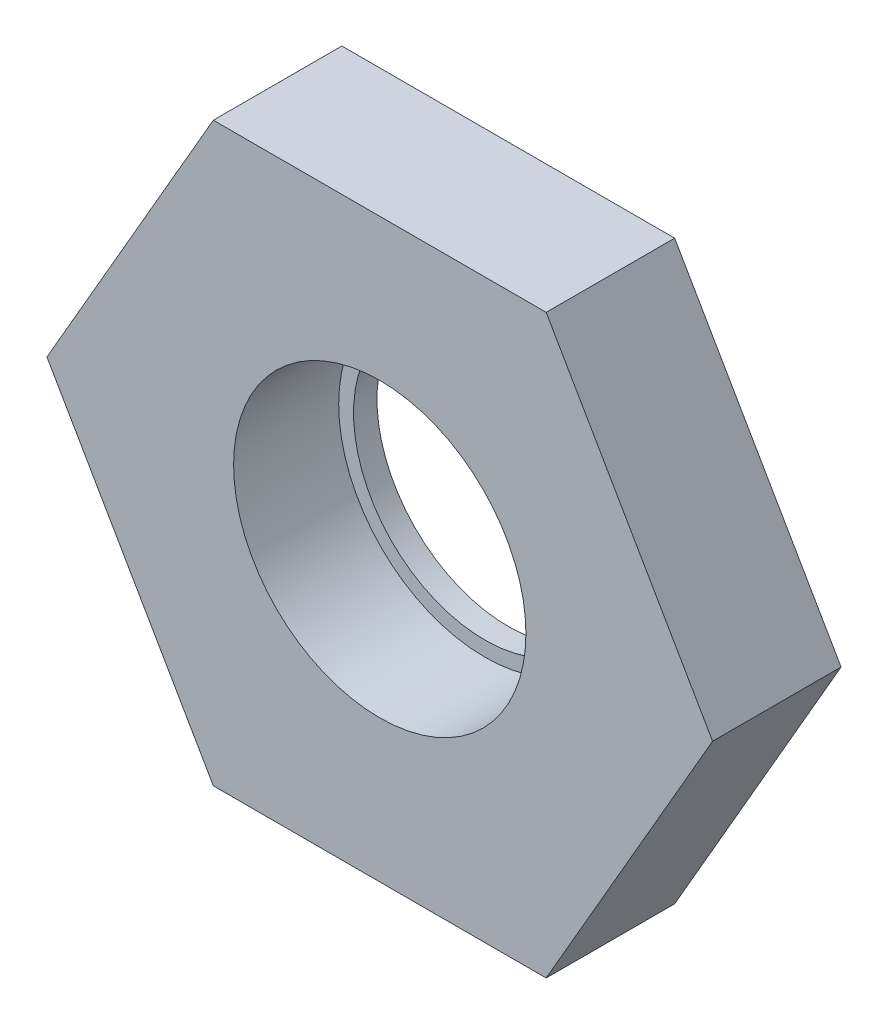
ISO-10303-21;
HEADER;
FILE_DESCRIPTION(('STEP AP214'),'2;1');
FILE_NAME('part.step','',(''),(''),'','','');
FILE_SCHEMA(('AUTOMOTIVE_DESIGN { 1 0 10303 214 1 1 1 1 }'));
ENDSEC;
DATA;
#1=APPLICATION_CONTEXT('core data for automotive mechanical design processes');
#2=APPLICATION_PROTOCOL_DEFINITION('international standard','automotive_design',2000,#1);
#3=PRODUCT_CONTEXT('',#1,'mechanical');
#4=PRODUCT('Part','Part','',(#3));
#5=PRODUCT_RELATED_PRODUCT_CATEGORY('part','',(#4));
#6=PRODUCT_DEFINITION_FORMATION('','',#4);
#7=PRODUCT_DEFINITION_CONTEXT('part definition',#1,'design');
#8=PRODUCT_DEFINITION('design','',#6,#7);
#9=PRODUCT_DEFINITION_SHAPE('','',#8);
#10=(LENGTH_UNIT() NAMED_UNIT(*) SI_UNIT(.MILLI.,.METRE.));
#11=(NAMED_UNIT(*) PLANE_ANGLE_UNIT() SI_UNIT($,.RADIAN.));
#12=(NAMED_UNIT(*) SI_UNIT($,.STERADIAN.) SOLID_ANGLE_UNIT());
#13=UNCERTAINTY_MEASURE_WITH_UNIT(LENGTH_MEASURE(1.E-05),#10,'distance_accuracy_value','');
#14=(GEOMETRIC_REPRESENTATION_CONTEXT(3) GLOBAL_UNCERTAINTY_ASSIGNED_CONTEXT((#13)) GLOBAL_UNIT_ASSIGNED_CONTEXT((#10,
#11,#12)) REPRESENTATION_CONTEXT('',''));
#15=CARTESIAN_POINT('',(0.,0.,0.));
#16=DIRECTION('',(0.,0.,1.));
#17=DIRECTION('',(1.,0.,0.));
#18=AXIS2_PLACEMENT_3D('',#15,#16,#17);
#19=CARTESIAN_POINT('',(5.95753309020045,-10.31875,4.826));
#20=DIRECTION('',(-0.866025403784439,0.5,0.));
#21=DIRECTION('',(-0.5,-0.866025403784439,0.));
#22=AXIS2_PLACEMENT_3D('',#19,#20,#21);
#23=PLANE('',#22);
#24=DIRECTION('',(0.5,0.866025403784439,0.));
#25=VECTOR('',#24,1.);
#26=CARTESIAN_POINT('',(5.95753309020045,-10.31875,4.6));
#27=LINE('',#26,#25);
#28=CARTESIAN_POINT('',(5.95753309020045,-10.31875,4.6));
#29=VERTEX_POINT('',#28);
#30=CARTESIAN_POINT('',(11.9150661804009,0.,4.6));
#31=VERTEX_POINT('',#30);
#32=EDGE_CURVE('E67',#29,#31,#27,.T.);
#33=ORIENTED_EDGE('',*,*,#32,.F.);
#34=DIRECTION('',(0.,0.,-1.));
#35=VECTOR('',#34,1.);
#36=CARTESIAN_POINT('',(5.95753309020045,-10.31875,4.826));
#37=LINE('',#36,#35);
#38=CARTESIAN_POINT('',(5.95753309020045,-10.31875,0.));
#39=VERTEX_POINT('',#38);
#40=EDGE_CURVE('E36',#29,#39,#37,.T.);
#41=ORIENTED_EDGE('',*,*,#40,.T.);
#42=DIRECTION('',(0.5,0.866025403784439,0.));
#43=VECTOR('',#42,1.);
#44=CARTESIAN_POINT('',(5.95753309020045,-10.31875,0.));
#45=LINE('',#44,#43);
#46=CARTESIAN_POINT('',(11.9150661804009,0.,0.));
#47=VERTEX_POINT('',#46);
#48=EDGE_CURVE('E106',#39,#47,#45,.T.);
#49=ORIENTED_EDGE('',*,*,#48,.T.);
#50=DIRECTION('',(0.,0.,-1.));
#51=VECTOR('',#50,1.);
#52=CARTESIAN_POINT('',(11.9150661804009,0.,4.826));
#53=LINE('',#52,#51);
#54=EDGE_CURVE('E9',#31,#47,#53,.T.);
#55=ORIENTED_EDGE('',*,*,#54,.F.);
#56=EDGE_LOOP('',(#33,#41,#49,#55));
#57=FACE_BOUND('',#56,.T.);
#58=ADVANCED_FACE('F14',(#57),#23,.F.);
#59=CARTESIAN_POINT('',(11.9150661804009,0.,4.826));
#60=DIRECTION('',(-0.866025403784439,-0.5,0.));
#61=DIRECTION('',(0.5,-0.866025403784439,0.));
#62=AXIS2_PLACEMENT_3D('',#59,#60,#61);
#63=PLANE('',#62);
#64=DIRECTION('',(-0.5,0.866025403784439,0.));
#65=VECTOR('',#64,1.);
#66=CARTESIAN_POINT('',(11.9150661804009,0.,4.6));
#67=LINE('',#66,#65);
#68=CARTESIAN_POINT('',(5.95753309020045,10.31875,4.6));
#69=VERTEX_POINT('',#68);
#70=EDGE_CURVE('E74',#31,#69,#67,.T.);
#71=ORIENTED_EDGE('',*,*,#70,.F.);
#72=ORIENTED_EDGE('',*,*,#54,.T.);
#73=DIRECTION('',(-0.5,0.866025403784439,0.));
#74=VECTOR('',#73,1.);
#75=CARTESIAN_POINT('',(11.9150661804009,0.,0.));
#76=LINE('',#75,#74);
#77=CARTESIAN_POINT('',(5.95753309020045,10.31875,0.));
#78=VERTEX_POINT('',#77);
#79=EDGE_CURVE('E103',#47,#78,#76,.T.);
#80=ORIENTED_EDGE('',*,*,#79,.T.);
#81=DIRECTION('',(0.,0.,-1.));
#82=VECTOR('',#81,1.);
#83=CARTESIAN_POINT('',(5.95753309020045,10.31875,4.826));
#84=LINE('',#83,#82);
#85=EDGE_CURVE('E21',#69,#78,#84,.T.);
#86=ORIENTED_EDGE('',*,*,#85,.F.);
#87=EDGE_LOOP('',(#71,#72,#80,#86));
#88=FACE_BOUND('',#87,.T.);
#89=ADVANCED_FACE('F104',(#88),#63,.F.);
#90=CARTESIAN_POINT('',(5.95753309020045,10.31875,4.826));
#91=DIRECTION('',(0.,-1.,0.));
#92=DIRECTION('',(0.,0.,-1.));
#93=AXIS2_PLACEMENT_3D('',#90,#91,#92);
#94=PLANE('',#93);
#95=DIRECTION('',(-1.,0.,0.));
#96=VECTOR('',#95,1.);
#97=CARTESIAN_POINT('',(5.95753309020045,10.31875,4.6));
#98=LINE('',#97,#96);
#99=CARTESIAN_POINT('',(-5.95753309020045,10.31875,4.6));
#100=VERTEX_POINT('',#99);
#101=EDGE_CURVE('E100',#69,#100,#98,.T.);
#102=ORIENTED_EDGE('',*,*,#101,.F.);
#103=ORIENTED_EDGE('',*,*,#85,.T.);
#104=DIRECTION('',(-1.,0.,0.));
#105=VECTOR('',#104,1.);
#106=CARTESIAN_POINT('',(5.95753309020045,10.31875,0.));
#107=LINE('',#106,#105);
#108=CARTESIAN_POINT('',(-5.95753309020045,10.31875,0.));
#109=VERTEX_POINT('',#108);
#110=EDGE_CURVE('E98',#78,#109,#107,.T.);
#111=ORIENTED_EDGE('',*,*,#110,.T.);
#112=DIRECTION('',(0.,0.,-1.));
#113=VECTOR('',#112,1.);
#114=CARTESIAN_POINT('',(-5.95753309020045,10.31875,4.826));
#115=LINE('',#114,#113);
#116=EDGE_CURVE('E89',#100,#109,#115,.T.);
#117=ORIENTED_EDGE('',*,*,#116,.F.);
#118=EDGE_LOOP('',(#102,#103,#111,#117));
#119=FACE_BOUND('',#118,.T.);
#120=ADVANCED_FACE('F95',(#119),#94,.F.);
#121=CARTESIAN_POINT('',(-5.95753309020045,10.31875,4.826));
#122=DIRECTION('',(0.866025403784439,-0.5,0.));
#123=DIRECTION('',(0.5,0.866025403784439,0.));
#124=AXIS2_PLACEMENT_3D('',#121,#122,#123);
#125=PLANE('',#124);
#126=DIRECTION('',(-0.5,-0.866025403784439,0.));
#127=VECTOR('',#126,1.);
#128=CARTESIAN_POINT('',(-5.95753309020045,10.31875,4.6));
#129=LINE('',#128,#127);
#130=CARTESIAN_POINT('',(-11.9150661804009,0.,4.6));
#131=VERTEX_POINT('',#130);
#132=EDGE_CURVE('E125',#100,#131,#129,.T.);
#133=ORIENTED_EDGE('',*,*,#132,.F.);
#134=ORIENTED_EDGE('',*,*,#116,.T.);
#135=DIRECTION('',(-0.5,-0.866025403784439,0.));
#136=VECTOR('',#135,1.);
#137=CARTESIAN_POINT('',(-5.95753309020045,10.31875,0.));
#138=LINE('',#137,#136);
#139=CARTESIAN_POINT('',(-11.9150661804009,0.,0.));
#140=VERTEX_POINT('',#139);
#141=EDGE_CURVE('E112',#109,#140,#138,.T.);
#142=ORIENTED_EDGE('',*,*,#141,.T.);
#143=DIRECTION('',(0.,0.,-1.));
#144=VECTOR('',#143,1.);
#145=CARTESIAN_POINT('',(-11.9150661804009,0.,4.826));
#146=LINE('',#145,#144);
#147=EDGE_CURVE('E82',#131,#140,#146,.T.);
#148=ORIENTED_EDGE('',*,*,#147,.F.);
#149=EDGE_LOOP('',(#133,#134,#142,#148));
#150=FACE_BOUND('',#149,.T.);
#151=ADVANCED_FACE('F164',(#150),#125,.F.);
#152=CARTESIAN_POINT('',(-11.9150661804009,0.,4.826));
#153=DIRECTION('',(0.866025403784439,0.5,0.));
#154=DIRECTION('',(-0.5,0.866025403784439,0.));
#155=AXIS2_PLACEMENT_3D('',#152,#153,#154);
#156=PLANE('',#155);
#157=DIRECTION('',(0.5,-0.866025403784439,0.));
#158=VECTOR('',#157,1.);
#159=CARTESIAN_POINT('',(-11.9150661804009,0.,4.6));
#160=LINE('',#159,#158);
#161=CARTESIAN_POINT('',(-5.95753309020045,-10.31875,4.6));
#162=VERTEX_POINT('',#161);
#163=EDGE_CURVE('E28',#131,#162,#160,.T.);
#164=ORIENTED_EDGE('',*,*,#163,.F.);
#165=ORIENTED_EDGE('',*,*,#147,.T.);
#166=DIRECTION('',(0.5,-0.866025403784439,0.));
#167=VECTOR('',#166,1.);
#168=CARTESIAN_POINT('',(-11.9150661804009,0.,0.));
#169=LINE('',#168,#167);
#170=CARTESIAN_POINT('',(-5.95753309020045,-10.31875,0.));
#171=VERTEX_POINT('',#170);
#172=EDGE_CURVE('E84',#140,#171,#169,.T.);
#173=ORIENTED_EDGE('',*,*,#172,.T.);
#174=DIRECTION('',(0.,0.,-1.));
#175=VECTOR('',#174,1.);
#176=CARTESIAN_POINT('',(-5.95753309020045,-10.31875,4.826));
#177=LINE('',#176,#175);
#178=EDGE_CURVE('E80',#162,#171,#177,.T.);
#179=ORIENTED_EDGE('',*,*,#178,.F.);
#180=EDGE_LOOP('',(#164,#165,#173,#179));
#181=FACE_BOUND('',#180,.T.);
#182=ADVANCED_FACE('F118',(#181),#156,.F.);
#183=CARTESIAN_POINT('',(-5.95753309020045,-10.31875,4.826));
#184=DIRECTION('',(0.,1.,0.));
#185=DIRECTION('',(0.,0.,1.));
#186=AXIS2_PLACEMENT_3D('',#183,#184,#185);
#187=PLANE('',#186);
#188=DIRECTION('',(1.,0.,0.));
#189=VECTOR('',#188,1.);
#190=CARTESIAN_POINT('',(-5.95753309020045,-10.31875,4.6));
#191=LINE('',#190,#189);
#192=EDGE_CURVE('E64',#162,#29,#191,.T.);
#193=ORIENTED_EDGE('',*,*,#192,.F.);
#194=ORIENTED_EDGE('',*,*,#178,.T.);
#195=DIRECTION('',(1.,0.,0.));
#196=VECTOR('',#195,1.);
#197=CARTESIAN_POINT('',(-5.95753309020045,-10.31875,0.));
#198=LINE('',#197,#196);
#199=EDGE_CURVE('E78',#171,#39,#198,.T.);
#200=ORIENTED_EDGE('',*,*,#199,.T.);
#201=ORIENTED_EDGE('',*,*,#40,.F.);
#202=EDGE_LOOP('',(#193,#194,#200,#201));
#203=FACE_BOUND('',#202,.T.);
#204=ADVANCED_FACE('F76',(#203),#187,.F.);
#205=CARTESIAN_POINT('',(0.,0.,-2.74796771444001));
#206=DIRECTION('',(0.,0.,-1.));
#207=DIRECTION('',(-1.,0.,0.));
#208=AXIS2_PLACEMENT_3D('',#205,#206,#207);
#209=CYLINDRICAL_SURFACE('',#208,5.2324);
#210=CARTESIAN_POINT('',(0.,0.,0.8382));
#211=DIRECTION('',(0.,0.,-1.));
#212=DIRECTION('',(-1.,0.,0.));
#213=AXIS2_PLACEMENT_3D('',#210,#211,#212);
#214=CIRCLE('',#213,5.2324);
#215=CARTESIAN_POINT('',(-5.2324,0.,0.8382));
#216=VERTEX_POINT('',#215);
#217=EDGE_CURVE('E120',#216,#216,#214,.T.);
#218=ORIENTED_EDGE('',*,*,#217,.T.);
#219=EDGE_LOOP('',(#218));
#220=FACE_BOUND('',#219,.T.);
#221=CARTESIAN_POINT('',(0.,0.,4.6));
#222=DIRECTION('',(0.,0.,1.));
#223=DIRECTION('',(1.,0.,0.));
#224=AXIS2_PLACEMENT_3D('',#221,#222,#223);
#225=CIRCLE('',#224,5.2324);
#226=CARTESIAN_POINT('',(5.2324,0.,4.6));
#227=VERTEX_POINT('',#226);
#228=EDGE_CURVE('E71',#227,#227,#225,.T.);
#229=ORIENTED_EDGE('',*,*,#228,.T.);
#230=EDGE_LOOP('',(#229));
#231=FACE_BOUND('',#230,.T.);
#232=ADVANCED_FACE('F151',(#220,#231),#209,.F.);
#233=CARTESIAN_POINT('',(17.8725992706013,10.31875,0.));
#234=DIRECTION('',(0.,0.,1.));
#235=DIRECTION('',(1.,0.,0.));
#236=AXIS2_PLACEMENT_3D('',#233,#234,#235);
#237=PLANE('',#236);
#238=ORIENTED_EDGE('',*,*,#48,.F.);
#239=ORIENTED_EDGE('',*,*,#199,.F.);
#240=ORIENTED_EDGE('',*,*,#172,.F.);
#241=ORIENTED_EDGE('',*,*,#141,.F.);
#242=ORIENTED_EDGE('',*,*,#110,.F.);
#243=ORIENTED_EDGE('',*,*,#79,.F.);
#244=EDGE_LOOP('',(#238,#239,#240,#241,#242,#243));
#245=FACE_BOUND('',#244,.T.);
#246=CARTESIAN_POINT('',(0.,0.,0.));
#247=DIRECTION('',(0.,0.,1.));
#248=DIRECTION('',(1.,0.,0.));
#249=AXIS2_PLACEMENT_3D('',#246,#247,#248);
#250=CIRCLE('',#249,4.7);
#251=CARTESIAN_POINT('',(4.7,0.,0.));
#252=VERTEX_POINT('',#251);
#253=EDGE_CURVE('E131',#252,#252,#250,.F.);
#254=ORIENTED_EDGE('',*,*,#253,.F.);
#255=EDGE_LOOP('',(#254));
#256=FACE_BOUND('',#255,.T.);
#257=ADVANCED_FACE('F108',(#245,#256),#237,.F.);
#258=CARTESIAN_POINT('',(5.2324,0.,0.8382));
#259=DIRECTION('',(0.,0.,1.));
#260=DIRECTION('',(1.,0.,0.));
#261=AXIS2_PLACEMENT_3D('',#258,#259,#260);
#262=PLANE('',#261);
#263=ORIENTED_EDGE('',*,*,#217,.F.);
#264=EDGE_LOOP('',(#263));
#265=FACE_BOUND('',#264,.T.);
#266=CARTESIAN_POINT('',(0.,0.,0.8382));
#267=DIRECTION('',(0.,0.,1.));
#268=DIRECTION('',(1.,0.,0.));
#269=AXIS2_PLACEMENT_3D('',#266,#267,#268);
#270=CIRCLE('',#269,4.7);
#271=CARTESIAN_POINT('',(4.7,0.,0.8382));
#272=VERTEX_POINT('',#271);
#273=EDGE_CURVE('E134',#272,#272,#270,.T.);
#274=ORIENTED_EDGE('',*,*,#273,.F.);
#275=EDGE_LOOP('',(#274));
#276=FACE_BOUND('',#275,.T.);
#277=ADVANCED_FACE('F140',(#265,#276),#262,.T.);
#278=CARTESIAN_POINT('',(5.95753309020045,-10.31875,4.6));
#279=DIRECTION('',(0.,0.,1.));
#280=DIRECTION('',(1.,0.,0.));
#281=AXIS2_PLACEMENT_3D('',#278,#279,#280);
#282=PLANE('',#281);
#283=ORIENTED_EDGE('',*,*,#192,.T.);
#284=ORIENTED_EDGE('',*,*,#32,.T.);
#285=ORIENTED_EDGE('',*,*,#70,.T.);
#286=ORIENTED_EDGE('',*,*,#101,.T.);
#287=ORIENTED_EDGE('',*,*,#132,.T.);
#288=ORIENTED_EDGE('',*,*,#163,.T.);
#289=EDGE_LOOP('',(#283,#284,#285,#286,#287,#288));
#290=FACE_BOUND('',#289,.T.);
#291=ORIENTED_EDGE('',*,*,#228,.F.);
#292=EDGE_LOOP('',(#291));
#293=FACE_BOUND('',#292,.T.);
#294=ADVANCED_FACE('F65',(#290,#293),#282,.T.);
#295=CARTESIAN_POINT('',(0.,0.,-14.799462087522));
#296=DIRECTION('',(0.,0.,1.));
#297=DIRECTION('',(1.,0.,0.));
#298=AXIS2_PLACEMENT_3D('',#295,#296,#297);
#299=CYLINDRICAL_SURFACE('',#298,4.7);
#300=ORIENTED_EDGE('',*,*,#253,.T.);
#301=EDGE_LOOP('',(#300));
#302=FACE_BOUND('',#301,.T.);
#303=ORIENTED_EDGE('',*,*,#273,.T.);
#304=EDGE_LOOP('',(#303));
#305=FACE_BOUND('',#304,.T.);
#306=ADVANCED_FACE('F138',(#302,#305),#299,.F.);
#307=CLOSED_SHELL('',(#58,#89,#120,#151,#182,#204,#232,#257,#277,#294,#306));
#308=MANIFOLD_SOLID_BREP('B1',#307);
#309=ADVANCED_BREP_SHAPE_REPRESENTATION('',(#18,#308),#14);
#310=SHAPE_DEFINITION_REPRESENTATION(#9,#309);
ENDSEC;
END-ISO-10303-21;
